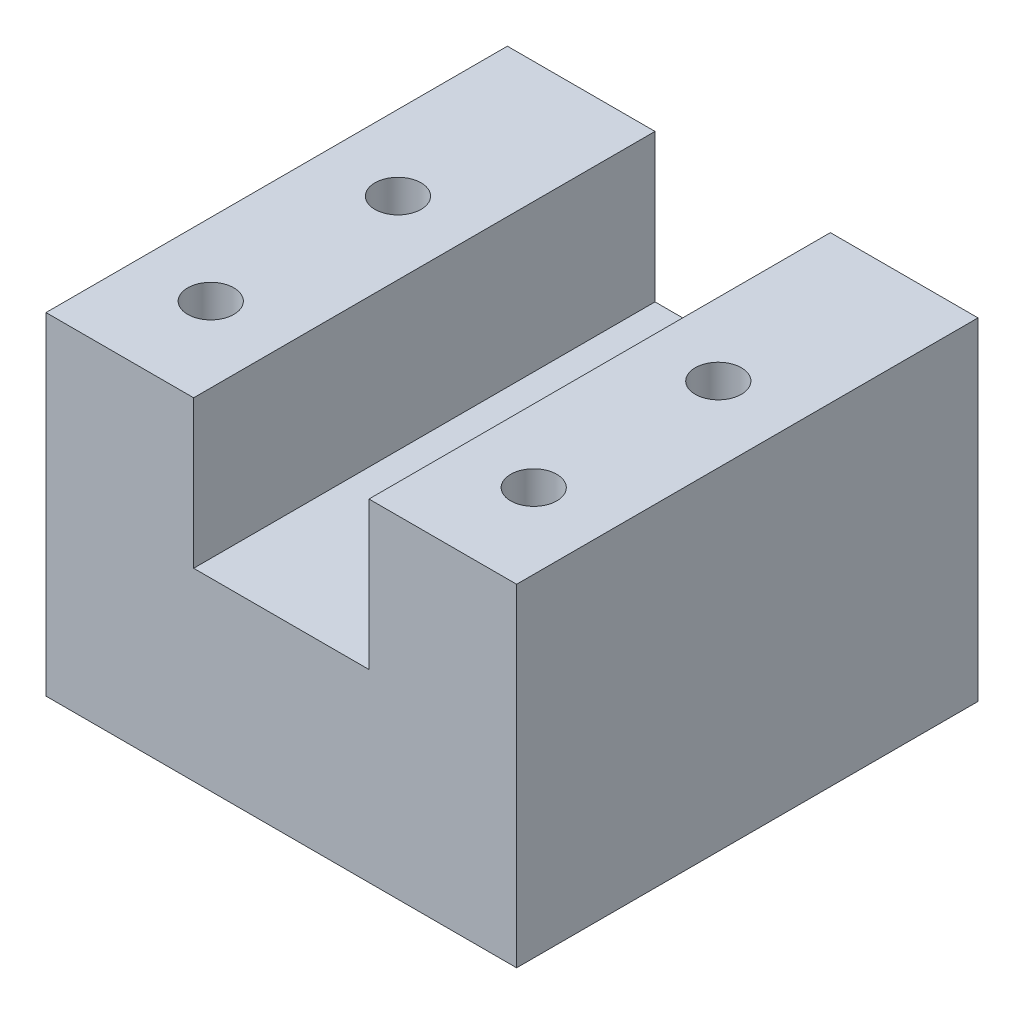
from build123d import *

# Parameters (mm, degrees)
EXTRUDE_1_DEPTH     = 25
SKETCH_3_R          = 1.25
CUT_EXTRUDE_1_DEPTH = 12
SKETCH_5_R          = 1.65
SKETCH_5_R_2        = 1.661097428
CUT_EXTRUDE_2_DEPTH = 12
SKETCH_6_R          = 2
CUT_EXTRUDE_3_DEPTH = 12


with BuildPart() as part:
    # Sketch 2 → Extrude 1 (new body)
    with BuildSketch(Plane.XY):
        Polygon((8, 10), (8, 18), (0, 18), (0, 0), (25.5, 0), (25.5, 18), (17.5, 18), (17.5, 10), align=None)
    extrude(amount=EXTRUDE_1_DEPTH)

    # Sketch 3 → Cut-Extrude 1 (cut)
    with BuildSketch(Plane(origin=(0, 18, 0), x_dir=(1, 0, 0), z_dir=(0, 1, 0))):
        with Locations(Location((3.928068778, -20, 0), (0, 0, 270))):
            Circle(SKETCH_3_R)
        with Locations(Location((21.428068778, -10, 0), (0, 0, 270))):
            Circle(SKETCH_3_R)
        with Locations(Location((21.428068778, -20, 0), (0, 0, 270))):
            Circle(SKETCH_3_R)
        with Locations(Location((4.071931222, -10, 0), (0, 0, 90))):
            Circle(SKETCH_3_R)
    extrude(amount=-CUT_EXTRUDE_1_DEPTH, mode=Mode.SUBTRACT)

    # Sketch 5 → Cut-Extrude 2 (cut)
    with BuildSketch(Plane.XZ):
        with Locations(Location((3.928068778, 15, 0), (0, 0, 270))):
            Circle(SKETCH_5_R)
        with Locations(Location((21.428068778, 15, 0), (0, 0, 270))):
            Circle(SKETCH_5_R_2)
    extrude(amount=-CUT_EXTRUDE_2_DEPTH, mode=Mode.SUBTRACT)

    # Sketch 6 → Cut-Extrude 3 (cut)
    with BuildSketch(Plane(origin=(0, 10, 0), x_dir=(1, 0, 0), z_dir=(0, 1, 0))):
        with Locations(Location((12.678068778, -6.5, 0), (0, 0, 270))):
            Circle(SKETCH_6_R)
    extrude(amount=-CUT_EXTRUDE_3_DEPTH, mode=Mode.SUBTRACT)


solid = part.part
